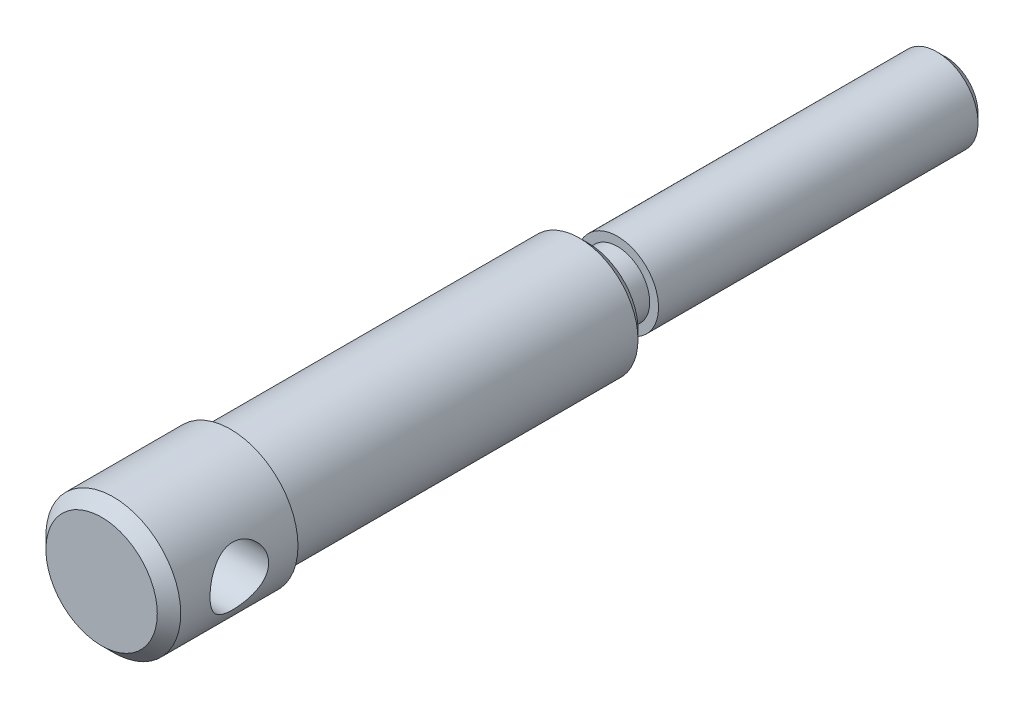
ISO-10303-21;
HEADER;
FILE_DESCRIPTION(('STEP AP214'),'2;1');
FILE_NAME('part.step','',(''),(''),'','','');
FILE_SCHEMA(('AUTOMOTIVE_DESIGN { 1 0 10303 214 1 1 1 1 }'));
ENDSEC;
DATA;
#1=APPLICATION_CONTEXT('core data for automotive mechanical design processes');
#2=APPLICATION_PROTOCOL_DEFINITION('international standard','automotive_design',2000,#1);
#3=PRODUCT_CONTEXT('',#1,'mechanical');
#4=PRODUCT('Part','Part','',(#3));
#5=PRODUCT_RELATED_PRODUCT_CATEGORY('part','',(#4));
#6=PRODUCT_DEFINITION_FORMATION('','',#4);
#7=PRODUCT_DEFINITION_CONTEXT('part definition',#1,'design');
#8=PRODUCT_DEFINITION('design','',#6,#7);
#9=PRODUCT_DEFINITION_SHAPE('','',#8);
#10=(LENGTH_UNIT() NAMED_UNIT(*) SI_UNIT(.MILLI.,.METRE.));
#11=(NAMED_UNIT(*) PLANE_ANGLE_UNIT() SI_UNIT($,.RADIAN.));
#12=(NAMED_UNIT(*) SI_UNIT($,.STERADIAN.) SOLID_ANGLE_UNIT());
#13=UNCERTAINTY_MEASURE_WITH_UNIT(LENGTH_MEASURE(1.E-05),#10,'distance_accuracy_value','');
#14=(GEOMETRIC_REPRESENTATION_CONTEXT(3) GLOBAL_UNCERTAINTY_ASSIGNED_CONTEXT((#13)) GLOBAL_UNIT_ASSIGNED_CONTEXT((#10,
#11,#12)) REPRESENTATION_CONTEXT('',''));
#15=CARTESIAN_POINT('',(0.,0.,0.));
#16=DIRECTION('',(0.,0.,1.));
#17=DIRECTION('',(1.,0.,0.));
#18=AXIS2_PLACEMENT_3D('',#15,#16,#17);
#19=CARTESIAN_POINT('',(0.,0.,-61.));
#20=DIRECTION('',(0.,0.,-1.));
#21=DIRECTION('',(-1.,0.,0.));
#22=AXIS2_PLACEMENT_3D('',#19,#20,#21);
#23=PLANE('',#22);
#24=CARTESIAN_POINT('',(0.,0.,-61.));
#25=DIRECTION('',(0.,0.,-1.));
#26=DIRECTION('',(-1.,0.,0.));
#27=AXIS2_PLACEMENT_3D('',#24,#25,#26);
#28=CIRCLE('',#27,8.49999999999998);
#29=CARTESIAN_POINT('',(-8.49999999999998,0.,-61.));
#30=VERTEX_POINT('',#29);
#31=EDGE_CURVE('E109',#30,#30,#28,.T.);
#32=ORIENTED_EDGE('',*,*,#31,.T.);
#33=EDGE_LOOP('',(#32));
#34=FACE_BOUND('',#33,.T.);
#35=CARTESIAN_POINT('',(0.,0.,-61.));
#36=DIRECTION('',(0.,0.,-1.));
#37=DIRECTION('',(-1.,0.,0.));
#38=AXIS2_PLACEMENT_3D('',#35,#36,#37);
#39=CIRCLE('',#38,5.5);
#40=CARTESIAN_POINT('',(-5.5,0.,-61.));
#41=VERTEX_POINT('',#40);
#42=EDGE_CURVE('E127',#41,#41,#39,.T.);
#43=ORIENTED_EDGE('',*,*,#42,.F.);
#44=EDGE_LOOP('',(#43));
#45=FACE_BOUND('',#44,.T.);
#46=ADVANCED_FACE('F33',(#34,#45),#23,.T.);
#47=CARTESIAN_POINT('',(0.,0.,0.));
#48=DIRECTION('',(0.,0.,1.));
#49=DIRECTION('',(1.,0.,0.));
#50=AXIS2_PLACEMENT_3D('',#47,#48,#49);
#51=PLANE('',#50);
#52=CARTESIAN_POINT('',(0.,0.,0.));
#53=DIRECTION('',(0.,0.,1.));
#54=DIRECTION('',(1.,0.,0.));
#55=AXIS2_PLACEMENT_3D('',#52,#53,#54);
#56=CIRCLE('',#55,11.5);
#57=CARTESIAN_POINT('',(11.5,0.,0.));
#58=VERTEX_POINT('',#57);
#59=EDGE_CURVE('E104',#58,#58,#56,.T.);
#60=ORIENTED_EDGE('',*,*,#59,.F.);
#61=EDGE_LOOP('',(#60));
#62=FACE_BOUND('',#61,.T.);
#63=CARTESIAN_POINT('',(0.,0.,0.));
#64=DIRECTION('',(0.,0.,1.));
#65=DIRECTION('',(1.,0.,0.));
#66=AXIS2_PLACEMENT_3D('',#63,#64,#65);
#67=CIRCLE('',#66,10.);
#68=CARTESIAN_POINT('',(10.,0.,0.));
#69=VERTEX_POINT('',#68);
#70=EDGE_CURVE('E107',#69,#69,#67,.F.);
#71=ORIENTED_EDGE('',*,*,#70,.F.);
#72=EDGE_LOOP('',(#71));
#73=FACE_BOUND('',#72,.T.);
#74=ADVANCED_FACE('F85',(#62,#73),#51,.F.);
#75=CARTESIAN_POINT('',(0.,0.,22.));
#76=DIRECTION('',(0.,0.,-1.));
#77=DIRECTION('',(-1.,0.,0.));
#78=AXIS2_PLACEMENT_3D('',#75,#76,#77);
#79=CYLINDRICAL_SURFACE('',#78,11.5);
#80=CARTESIAN_POINT('',(-11.5,0.,15.));
#81=CARTESIAN_POINT('',(-11.4999991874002,-0.133458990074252,14.9999990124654));
#82=CARTESIAN_POINT('',(-11.4976705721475,-0.26695594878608,14.9946495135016));
#83=CARTESIAN_POINT('',(-11.4884139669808,-0.532992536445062,14.9733032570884));
#84=CARTESIAN_POINT('',(-11.4814832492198,-0.665531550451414,14.9573001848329));
#85=CARTESIAN_POINT('',(-11.4631869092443,-0.928868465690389,14.9147760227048));
#86=CARTESIAN_POINT('',(-11.4518127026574,-1.05966248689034,14.8882345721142));
#87=CARTESIAN_POINT('',(-11.4249225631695,-1.31835845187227,14.8249017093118));
#88=CARTESIAN_POINT('',(-11.4094049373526,-1.44625919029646,14.7881061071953));
#89=CARTESIAN_POINT('',(-11.3746919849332,-1.69777130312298,14.7047897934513));
#90=CARTESIAN_POINT('',(-11.3555114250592,-1.8213976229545,14.658308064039));
#91=CARTESIAN_POINT('',(-11.3139069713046,-2.06414861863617,14.5559488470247));
#92=CARTESIAN_POINT('',(-11.2914818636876,-2.18327158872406,14.5000678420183));
#93=CARTESIAN_POINT('',(-11.220154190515,-2.53267560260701,14.3190527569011));
#94=CARTESIAN_POINT('',(-11.16715245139,-2.75531587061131,14.1804382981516));
#95=CARTESIAN_POINT('',(-11.0523644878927,-3.18549178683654,13.8636267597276));
#96=CARTESIAN_POINT('',(-10.9902747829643,-3.39174967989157,13.6838207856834));
#97=CARTESIAN_POINT('',(-10.8655004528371,-3.77240336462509,13.2929199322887));
#98=CARTESIAN_POINT('',(-10.8028155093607,-3.94678096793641,13.0818073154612));
#99=CARTESIAN_POINT('',(-10.7116625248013,-4.18546415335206,12.7391163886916));
#100=CARTESIAN_POINT('',(-10.6810107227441,-4.26287209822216,12.6170371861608));
#101=CARTESIAN_POINT('',(-10.6223314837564,-4.40705355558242,12.3661735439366));
#102=CARTESIAN_POINT('',(-10.5943029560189,-4.47383149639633,12.2373919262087));
#103=CARTESIAN_POINT('',(-10.5418047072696,-4.59617141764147,11.9739080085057));
#104=CARTESIAN_POINT('',(-10.5173350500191,-4.65173319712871,11.8392056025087));
#105=CARTESIAN_POINT('',(-10.4728466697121,-4.75104678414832,11.5648696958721));
#106=CARTESIAN_POINT('',(-10.452825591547,-4.79480484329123,11.4252388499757));
#107=CARTESIAN_POINT('',(-10.4188750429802,-4.86812001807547,11.149239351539));
#108=CARTESIAN_POINT('',(-10.4046884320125,-4.89828406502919,11.0130635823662));
#109=CARTESIAN_POINT('',(-10.3815389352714,-4.94715913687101,10.7382925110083));
#110=CARTESIAN_POINT('',(-10.3725735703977,-4.96587559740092,10.5996983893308));
#111=CARTESIAN_POINT('',(-10.360204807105,-4.9916291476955,10.3212246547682));
#112=CARTESIAN_POINT('',(-10.3567996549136,-4.99866992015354,10.1813454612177));
#113=CARTESIAN_POINT('',(-10.3556810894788,-5.00098714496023,9.90147108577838));
#114=CARTESIAN_POINT('',(-10.357967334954,-4.99626430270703,9.76147591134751));
#115=CARTESIAN_POINT('',(-10.3677045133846,-4.97602372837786,9.49447266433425));
#116=CARTESIAN_POINT('',(-10.3746988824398,-4.96145987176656,9.36737419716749));
#117=CARTESIAN_POINT('',(-10.3931455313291,-4.92270111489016,9.11494283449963));
#118=CARTESIAN_POINT('',(-10.404599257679,-4.89850308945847,8.98961052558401));
#119=CARTESIAN_POINT('',(-10.4316044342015,-4.84072766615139,8.7416047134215));
#120=CARTESIAN_POINT('',(-10.4471550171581,-4.80715225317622,8.61893065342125));
#121=CARTESIAN_POINT('',(-10.4818866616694,-4.7309405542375,8.37694125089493));
#122=CARTESIAN_POINT('',(-10.5010691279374,-4.68830076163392,8.25762722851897));
#123=CARTESIAN_POINT('',(-10.5641703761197,-4.5452578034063,7.90067398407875));
#124=CARTESIAN_POINT('',(-10.613035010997,-4.43096553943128,7.66930179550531));
#125=CARTESIAN_POINT('',(-10.7185281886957,-4.16929093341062,7.22819012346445));
#126=CARTESIAN_POINT('',(-10.7751599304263,-4.02189494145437,7.01845961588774));
#127=CARTESIAN_POINT('',(-10.8961990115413,-3.6821595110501,6.60595388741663));
#128=CARTESIAN_POINT('',(-10.9608402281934,-3.48691870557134,6.40563019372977));
#129=CARTESIAN_POINT('',(-11.086242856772,-3.06488466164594,6.0396446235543));
#130=CARTESIAN_POINT('',(-11.147003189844,-2.83808270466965,5.87399235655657));
#131=CARTESIAN_POINT('',(-11.2312180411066,-2.47504570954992,5.65315952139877));
#132=CARTESIAN_POINT('',(-11.2584559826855,-2.34834010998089,5.5834064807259));
#133=CARTESIAN_POINT('',(-11.3094784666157,-2.08881378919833,5.45491592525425));
#134=CARTESIAN_POINT('',(-11.3332644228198,-1.95599560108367,5.39617389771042));
#135=CARTESIAN_POINT('',(-11.3766831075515,-1.68519695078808,5.29030277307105));
#136=CARTESIAN_POINT('',(-11.396316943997,-1.54721787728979,5.24317057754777));
#137=CARTESIAN_POINT('',(-11.4308489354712,-1.26712004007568,5.16102293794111));
#138=CARTESIAN_POINT('',(-11.4457474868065,-1.12500162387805,5.12600647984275));
#139=CARTESIAN_POINT('',(-11.4695142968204,-0.847527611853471,5.07046221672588));
#140=CARTESIAN_POINT('',(-11.4787222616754,-0.712364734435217,5.04911465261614));
#141=CARTESIAN_POINT('',(-11.4923657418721,-0.440508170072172,5.01756344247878));
#142=CARTESIAN_POINT('',(-11.4968015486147,-0.303814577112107,5.00735911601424));
#143=CARTESIAN_POINT('',(-11.5007756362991,-0.0300171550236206,4.99821461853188));
#144=CARTESIAN_POINT('',(-11.5003152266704,0.107086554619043,4.99927143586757));
#145=CARTESIAN_POINT('',(-11.4945129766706,0.380638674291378,5.01262944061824));
#146=CARTESIAN_POINT('',(-11.4891712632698,0.51708710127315,5.02493033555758));
#147=CARTESIAN_POINT('',(-11.474184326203,0.780740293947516,5.05964223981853));
#148=CARTESIAN_POINT('',(-11.4647935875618,0.908038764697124,5.08145615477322));
#149=CARTESIAN_POINT('',(-11.4420202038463,1.16026535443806,5.13477575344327));
#150=CARTESIAN_POINT('',(-11.428636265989,1.28519269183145,5.16628457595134));
#151=CARTESIAN_POINT('',(-11.3982018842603,1.53180217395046,5.23868859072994));
#152=CARTESIAN_POINT('',(-11.3811524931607,1.65348523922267,5.27958108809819));
#153=CARTESIAN_POINT('',(-11.3437879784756,1.89293275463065,5.3703964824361));
#154=CARTESIAN_POINT('',(-11.3234716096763,2.01069568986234,5.420322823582));
#155=CARTESIAN_POINT('',(-11.2569520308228,2.36421123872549,5.58643538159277));
#156=CARTESIAN_POINT('',(-11.2061439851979,2.59265514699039,5.71674199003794));
#157=CARTESIAN_POINT('',(-11.097227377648,3.02514032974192,6.01038824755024));
#158=CARTESIAN_POINT('',(-11.0391156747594,3.22917103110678,6.17374212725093));
#159=CARTESIAN_POINT('',(-10.916220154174,3.62381816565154,6.54361108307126));
#160=CARTESIAN_POINT('',(-10.8512681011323,3.81217300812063,6.75248862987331));
#161=CARTESIAN_POINT('',(-10.7258763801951,4.15192368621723,7.19993633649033));
#162=CARTESIAN_POINT('',(-10.6654381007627,4.30330818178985,7.4385155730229));
#163=CARTESIAN_POINT('',(-10.5830304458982,4.50051999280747,7.81684403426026));
#164=CARTESIAN_POINT('',(-10.556709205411,4.56175038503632,7.94782384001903));
#165=CARTESIAN_POINT('',(-10.5080085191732,4.67284041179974,8.21520693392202));
#166=CARTESIAN_POINT('',(-10.4856273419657,4.72270504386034,8.35160780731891));
#167=CARTESIAN_POINT('',(-10.4456403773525,4.81050174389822,8.62879481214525));
#168=CARTESIAN_POINT('',(-10.4280320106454,4.84844025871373,8.76957852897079));
#169=CARTESIAN_POINT('',(-10.3982674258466,4.91195173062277,9.05447381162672));
#170=CARTESIAN_POINT('',(-10.386110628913,4.93752600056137,9.19858502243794));
#171=CARTESIAN_POINT('',(-10.368506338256,4.97437987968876,9.4769279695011));
#172=CARTESIAN_POINT('',(-10.3625895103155,4.98666164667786,9.61099814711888));
#173=CARTESIAN_POINT('',(-10.3559835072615,5.00036654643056,9.8798183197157));
#174=CARTESIAN_POINT('',(-10.355294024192,5.00179031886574,10.0145682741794));
#175=CARTESIAN_POINT('',(-10.3591678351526,4.99376218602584,10.2836432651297));
#176=CARTESIAN_POINT('',(-10.3637302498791,4.9843121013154,10.4179683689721));
#177=CARTESIAN_POINT('',(-10.3779395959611,4.95465826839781,10.685149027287));
#178=CARTESIAN_POINT('',(-10.3875864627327,4.93445465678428,10.8180046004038));
#179=CARTESIAN_POINT('',(-10.4109570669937,4.884943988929,11.073943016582));
#180=CARTESIAN_POINT('',(-10.4244250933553,4.85620381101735,11.1971592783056));
#181=CARTESIAN_POINT('',(-10.4551810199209,4.78962681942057,11.4406336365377));
#182=CARTESIAN_POINT('',(-10.4724701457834,4.75178708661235,11.560890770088));
#183=CARTESIAN_POINT('',(-10.5293421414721,4.62510393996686,11.9161203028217));
#184=CARTESIAN_POINT('',(-10.5739466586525,4.52306237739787,12.1457253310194));
#185=CARTESIAN_POINT('',(-10.6749593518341,4.27943987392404,12.5993996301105));
#186=CARTESIAN_POINT('',(-10.7319331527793,4.1357771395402,12.822214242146));
#187=CARTESIAN_POINT('',(-10.8498359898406,3.81577872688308,13.2418404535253));
#188=CARTESIAN_POINT('',(-10.910766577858,3.63943017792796,13.4386417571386));
#189=CARTESIAN_POINT('',(-11.0357566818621,3.24172928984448,13.8173965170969));
#190=CARTESIAN_POINT('',(-11.0996617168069,3.01786924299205,13.9967998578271));
#191=CARTESIAN_POINT('',(-11.188695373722,2.66050657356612,14.2358410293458));
#192=CARTESIAN_POINT('',(-11.2172565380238,2.53768075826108,14.3105596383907));
#193=CARTESIAN_POINT('',(-11.2713284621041,2.28554894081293,14.4493750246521));
#194=CARTESIAN_POINT('',(-11.296840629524,2.1562459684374,14.513476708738));
#195=CARTESIAN_POINT('',(-11.3437846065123,1.89370361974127,14.6297126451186));
#196=CARTESIAN_POINT('',(-11.3652646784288,1.7605362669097,14.6819902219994));
#197=CARTESIAN_POINT('',(-11.4039238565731,1.48970271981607,14.7750678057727));
#198=CARTESIAN_POINT('',(-11.4211050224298,1.35203871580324,14.8158733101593));
#199=CARTESIAN_POINT('',(-11.4506339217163,1.0735659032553,14.8854896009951));
#200=CARTESIAN_POINT('',(-11.4629933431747,0.932765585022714,14.9143294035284));
#201=CARTESIAN_POINT('',(-11.4825565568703,0.648923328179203,14.9597913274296));
#202=CARTESIAN_POINT('',(-11.4897640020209,0.505883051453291,14.9764221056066));
#203=CARTESIAN_POINT('',(-11.4961903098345,0.302085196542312,14.9912325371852));
#204=CARTESIAN_POINT('',(-11.4976179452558,0.241727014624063,14.9945192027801));
#205=CARTESIAN_POINT('',(-11.4995229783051,0.120915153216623,14.9989031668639));
#206=CARTESIAN_POINT('',(-11.5000003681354,0.0604614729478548,15.0000004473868));
#207=CARTESIAN_POINT('',(-11.5,0.,15.));
#208=B_SPLINE_CURVE_WITH_KNOTS('',3,(#80,#81,#82,#83,#84,#85,#86,#87,#88,#89,#90,#91,#92,#93,
#94,#95,#96,#97,#98,#99,#100,#101,#102,#103,#104,#105,#106,#107,#108,#109,#110,#111,#112,#113,
#114,#115,#116,#117,#118,#119,#120,#121,#122,#123,#124,#125,#126,#127,#128,#129,#130,#131,#132,
#133,#134,#135,#136,#137,#138,#139,#140,#141,#142,#143,#144,#145,#146,#147,#148,#149,#150,#151,
#152,#153,#154,#155,#156,#157,#158,#159,#160,#161,#162,#163,#164,#165,#166,#167,#168,#169,#170,
#171,#172,#173,#174,#175,#176,#177,#178,#179,#180,#181,#182,#183,#184,#185,#186,#187,#188,#189,
#190,#191,#192,#193,#194,#195,#196,#197,#198,#199,#200,#201,#202,#203,#204,#205,#206,#207),
.UNSPECIFIED.,.T.,.F.,(4,2,2,2,2,2,2,2,2,2,2,2,2,2,2,2,2,2,2,2,2,2,2,2,2,2,2,2,2,2,2,2,2,2,2,2,
2,2,2,2,2,2,2,2,2,2,2,2,2,2,2,2,2,2,2,2,2,2,2,2,2,2,2,4),(0.,0.400315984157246,
0.800869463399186,1.20220062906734,1.60369602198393,2.00360575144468,2.40366546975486,
3.20276215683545,4.04108097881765,4.8798765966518,5.32271314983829,5.7653647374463,
6.20802425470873,6.65044886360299,7.07046867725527,7.49028889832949,7.90997667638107,
8.32963928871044,8.71355143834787,9.09758822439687,9.48154378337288,9.86564815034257,
10.650033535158,11.4347429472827,12.2922718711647,13.1500381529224,13.5910935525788,
14.0319677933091,14.4727242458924,14.9134438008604,15.3243552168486,15.7352415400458,
16.1460179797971,16.5567837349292,16.9448202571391,17.3329825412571,17.7210334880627,
18.1092326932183,18.9090979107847,19.7093082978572,20.5714732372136,21.4339023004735,
21.8742960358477,22.314495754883,22.7544571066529,23.1943717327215,23.5981280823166,
24.0018606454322,24.405525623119,24.8091854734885,25.1904633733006,25.5718637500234,
26.3341347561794,27.1443093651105,27.9548036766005,28.8319183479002,29.2711960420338,
29.7102701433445,30.1436967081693,30.5769152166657,31.009076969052,31.4409320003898,
31.6222873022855,31.803644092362),.UNSPECIFIED.);
#209=CARTESIAN_POINT('',(-11.5,0.,15.));
#210=VERTEX_POINT('',#209);
#211=EDGE_CURVE('E37',#210,#210,#208,.T.);
#212=ORIENTED_EDGE('',*,*,#211,.T.);
#213=EDGE_LOOP('',(#212));
#214=FACE_BOUND('',#213,.T.);
#215=CARTESIAN_POINT('',(11.5,0.,5.));
#216=CARTESIAN_POINT('',(11.4999991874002,-0.133458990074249,5.00000098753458));
#217=CARTESIAN_POINT('',(11.4976705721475,-0.266955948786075,5.00535048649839));
#218=CARTESIAN_POINT('',(11.4884139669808,-0.532992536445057,5.02669674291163));
#219=CARTESIAN_POINT('',(11.4814832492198,-0.665531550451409,5.04269981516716));
#220=CARTESIAN_POINT('',(11.4631869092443,-0.928868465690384,5.0852239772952));
#221=CARTESIAN_POINT('',(11.4518127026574,-1.05966248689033,5.11176542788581));
#222=CARTESIAN_POINT('',(11.4249225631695,-1.31835845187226,5.17509829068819));
#223=CARTESIAN_POINT('',(11.4094049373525,-1.44625919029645,5.21189389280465));
#224=CARTESIAN_POINT('',(11.3746919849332,-1.69777130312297,5.29521020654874));
#225=CARTESIAN_POINT('',(11.3555114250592,-1.82139762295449,5.34169193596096));
#226=CARTESIAN_POINT('',(11.3139069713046,-2.06414861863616,5.44405115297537));
#227=CARTESIAN_POINT('',(11.2914818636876,-2.18327158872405,5.49993215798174));
#228=CARTESIAN_POINT('',(11.220154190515,-2.532675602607,5.6809472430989));
#229=CARTESIAN_POINT('',(11.1671524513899,-2.75531587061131,5.81956170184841));
#230=CARTESIAN_POINT('',(11.0523644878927,-3.18549178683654,6.13637324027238));
#231=CARTESIAN_POINT('',(10.9902747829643,-3.39174967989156,6.31617921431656));
#232=CARTESIAN_POINT('',(10.8655004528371,-3.77240336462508,6.70708006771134));
#233=CARTESIAN_POINT('',(10.8028155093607,-3.94678096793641,6.91819268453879));
#234=CARTESIAN_POINT('',(10.7116625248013,-4.18546415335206,7.26088361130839));
#235=CARTESIAN_POINT('',(10.6810107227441,-4.26287209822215,7.38296281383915));
#236=CARTESIAN_POINT('',(10.6223314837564,-4.40705355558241,7.63382645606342));
#237=CARTESIAN_POINT('',(10.5943029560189,-4.47383149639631,7.76260807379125));
#238=CARTESIAN_POINT('',(10.5418047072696,-4.59617141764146,8.02609199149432));
#239=CARTESIAN_POINT('',(10.5173350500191,-4.65173319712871,8.16079439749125));
#240=CARTESIAN_POINT('',(10.4728466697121,-4.75104678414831,8.43513030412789));
#241=CARTESIAN_POINT('',(10.4528255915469,-4.79480484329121,8.57476115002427));
#242=CARTESIAN_POINT('',(10.4188750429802,-4.86812001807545,8.85076064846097));
#243=CARTESIAN_POINT('',(10.4046884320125,-4.89828406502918,8.98693641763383));
#244=CARTESIAN_POINT('',(10.3815389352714,-4.94715913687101,9.26170748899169));
#245=CARTESIAN_POINT('',(10.3725735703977,-4.96587559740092,9.40030161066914));
#246=CARTESIAN_POINT('',(10.360204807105,-4.9916291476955,9.67877534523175));
#247=CARTESIAN_POINT('',(10.3567996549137,-4.99866992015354,9.81865453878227));
#248=CARTESIAN_POINT('',(10.3556810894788,-5.00098714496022,10.0985289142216));
#249=CARTESIAN_POINT('',(10.357967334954,-4.99626430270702,10.2385240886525));
#250=CARTESIAN_POINT('',(10.3677045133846,-4.97602372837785,10.5055273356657));
#251=CARTESIAN_POINT('',(10.3746988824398,-4.96145987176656,10.6326258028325));
#252=CARTESIAN_POINT('',(10.3931455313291,-4.92270111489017,10.8850571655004));
#253=CARTESIAN_POINT('',(10.404599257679,-4.89850308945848,11.010389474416));
#254=CARTESIAN_POINT('',(10.4316044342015,-4.8407276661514,11.2583952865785));
#255=CARTESIAN_POINT('',(10.4471550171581,-4.80715225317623,11.3810693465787));
#256=CARTESIAN_POINT('',(10.4818866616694,-4.73094055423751,11.6230587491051));
#257=CARTESIAN_POINT('',(10.5010691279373,-4.68830076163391,11.742372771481));
#258=CARTESIAN_POINT('',(10.5641703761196,-4.54525780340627,12.0993260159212));
#259=CARTESIAN_POINT('',(10.6130350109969,-4.43096553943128,12.3306982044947));
#260=CARTESIAN_POINT('',(10.7185281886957,-4.16929093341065,12.7718098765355));
#261=CARTESIAN_POINT('',(10.7751599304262,-4.02189494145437,12.9815403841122));
#262=CARTESIAN_POINT('',(10.8961990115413,-3.6821595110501,13.3940461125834));
#263=CARTESIAN_POINT('',(10.9608402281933,-3.48691870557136,13.5943698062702));
#264=CARTESIAN_POINT('',(11.086242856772,-3.06488466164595,13.9603553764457));
#265=CARTESIAN_POINT('',(11.1470031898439,-2.83808270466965,14.1260076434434));
#266=CARTESIAN_POINT('',(11.2312180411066,-2.47504570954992,14.3468404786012));
#267=CARTESIAN_POINT('',(11.2584559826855,-2.3483401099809,14.4165935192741));
#268=CARTESIAN_POINT('',(11.3094784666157,-2.08881378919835,14.5450840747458));
#269=CARTESIAN_POINT('',(11.3332644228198,-1.95599560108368,14.6038261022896));
#270=CARTESIAN_POINT('',(11.3766831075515,-1.68519695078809,14.709697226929));
#271=CARTESIAN_POINT('',(11.396316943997,-1.54721787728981,14.7568294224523));
#272=CARTESIAN_POINT('',(11.4308489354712,-1.26712004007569,14.8389770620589));
#273=CARTESIAN_POINT('',(11.4457474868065,-1.12500162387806,14.8739935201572));
#274=CARTESIAN_POINT('',(11.4695142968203,-0.847527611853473,14.9295377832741));
#275=CARTESIAN_POINT('',(11.4787222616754,-0.712364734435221,14.9508853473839));
#276=CARTESIAN_POINT('',(11.4923657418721,-0.440508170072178,14.9824365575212));
#277=CARTESIAN_POINT('',(11.4968015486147,-0.303814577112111,14.9926408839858));
#278=CARTESIAN_POINT('',(11.5007756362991,-0.0300171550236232,15.0017853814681));
#279=CARTESIAN_POINT('',(11.5003152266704,0.107086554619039,15.0007285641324));
#280=CARTESIAN_POINT('',(11.4945129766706,0.380638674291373,14.9873705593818));
#281=CARTESIAN_POINT('',(11.4891712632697,0.517087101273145,14.9750696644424));
#282=CARTESIAN_POINT('',(11.474184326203,0.780740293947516,14.9403577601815));
#283=CARTESIAN_POINT('',(11.4647935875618,0.908038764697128,14.9185438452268));
#284=CARTESIAN_POINT('',(11.4420202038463,1.16026535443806,14.8652242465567));
#285=CARTESIAN_POINT('',(11.428636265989,1.28519269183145,14.8337154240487));
#286=CARTESIAN_POINT('',(11.3982018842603,1.53180217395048,14.7613114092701));
#287=CARTESIAN_POINT('',(11.3811524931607,1.65348523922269,14.7204189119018));
#288=CARTESIAN_POINT('',(11.3437879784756,1.89293275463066,14.6296035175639));
#289=CARTESIAN_POINT('',(11.3234716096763,2.01069568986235,14.579677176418));
#290=CARTESIAN_POINT('',(11.2569520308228,2.36421123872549,14.4135646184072));
#291=CARTESIAN_POINT('',(11.2061439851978,2.59265514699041,14.2832580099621));
#292=CARTESIAN_POINT('',(11.097227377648,3.02514032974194,13.9896117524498));
#293=CARTESIAN_POINT('',(11.0391156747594,3.22917103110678,13.8262578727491));
#294=CARTESIAN_POINT('',(10.916220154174,3.62381816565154,13.4563889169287));
#295=CARTESIAN_POINT('',(10.8512681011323,3.81217300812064,13.2475113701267));
#296=CARTESIAN_POINT('',(10.7258763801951,4.15192368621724,12.8000636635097));
#297=CARTESIAN_POINT('',(10.6654381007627,4.30330818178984,12.5614844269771));
#298=CARTESIAN_POINT('',(10.5830304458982,4.50051999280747,12.1831559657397));
#299=CARTESIAN_POINT('',(10.556709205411,4.56175038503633,12.052176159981));
#300=CARTESIAN_POINT('',(10.5080085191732,4.67284041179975,11.784793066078));
#301=CARTESIAN_POINT('',(10.4856273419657,4.72270504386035,11.6483921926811));
#302=CARTESIAN_POINT('',(10.4456403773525,4.81050174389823,11.3712051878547));
#303=CARTESIAN_POINT('',(10.4280320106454,4.84844025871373,11.2304214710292));
#304=CARTESIAN_POINT('',(10.3982674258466,4.91195173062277,10.9455261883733));
#305=CARTESIAN_POINT('',(10.386110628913,4.93752600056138,10.801414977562));
#306=CARTESIAN_POINT('',(10.368506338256,4.97437987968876,10.5230720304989));
#307=CARTESIAN_POINT('',(10.3625895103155,4.98666164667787,10.3890018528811));
#308=CARTESIAN_POINT('',(10.3559835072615,5.00036654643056,10.1201816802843));
#309=CARTESIAN_POINT('',(10.355294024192,5.00179031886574,9.98543172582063));
#310=CARTESIAN_POINT('',(10.3591678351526,4.99376218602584,9.71635673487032));
#311=CARTESIAN_POINT('',(10.3637302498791,4.98431210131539,9.58203163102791));
#312=CARTESIAN_POINT('',(10.3779395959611,4.95465826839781,9.31485097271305));
#313=CARTESIAN_POINT('',(10.3875864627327,4.93445465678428,9.18199539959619));
#314=CARTESIAN_POINT('',(10.4109570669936,4.884943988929,8.92605698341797));
#315=CARTESIAN_POINT('',(10.4244250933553,4.85620381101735,8.80284072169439));
#316=CARTESIAN_POINT('',(10.4551810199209,4.78962681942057,8.55936636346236));
#317=CARTESIAN_POINT('',(10.4724701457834,4.75178708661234,8.43910922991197));
#318=CARTESIAN_POINT('',(10.5293421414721,4.62510393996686,8.08387969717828));
#319=CARTESIAN_POINT('',(10.5739466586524,4.52306237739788,7.85427466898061));
#320=CARTESIAN_POINT('',(10.6749593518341,4.27943987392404,7.40060036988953));
#321=CARTESIAN_POINT('',(10.7319331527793,4.13577713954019,7.17778575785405));
#322=CARTESIAN_POINT('',(10.8498359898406,3.81577872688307,6.75815954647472));
#323=CARTESIAN_POINT('',(10.910766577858,3.63943017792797,6.56135824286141));
#324=CARTESIAN_POINT('',(11.0357566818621,3.24172928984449,6.18260348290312));
#325=CARTESIAN_POINT('',(11.0996617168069,3.01786924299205,6.00320014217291));
#326=CARTESIAN_POINT('',(11.188695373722,2.66050657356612,5.7641589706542));
#327=CARTESIAN_POINT('',(11.2172565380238,2.53768075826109,5.68944036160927));
#328=CARTESIAN_POINT('',(11.2713284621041,2.28554894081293,5.55062497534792));
#329=CARTESIAN_POINT('',(11.296840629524,2.1562459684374,5.48652329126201));
#330=CARTESIAN_POINT('',(11.3437846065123,1.89370361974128,5.37028735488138));
#331=CARTESIAN_POINT('',(11.3652646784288,1.76053626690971,5.31800977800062));
#332=CARTESIAN_POINT('',(11.4039238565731,1.48970271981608,5.22493219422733));
#333=CARTESIAN_POINT('',(11.4211050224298,1.35203871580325,5.18412668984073));
#334=CARTESIAN_POINT('',(11.4506339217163,1.0735659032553,5.11451039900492));
#335=CARTESIAN_POINT('',(11.4629933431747,0.932765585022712,5.08567059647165));
#336=CARTESIAN_POINT('',(11.4825565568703,0.648923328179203,5.04020867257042));
#337=CARTESIAN_POINT('',(11.4897640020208,0.505883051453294,5.02357789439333));
#338=CARTESIAN_POINT('',(11.4961903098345,0.302085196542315,5.0087674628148));
#339=CARTESIAN_POINT('',(11.4976179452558,0.241727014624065,5.00548079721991));
#340=CARTESIAN_POINT('',(11.4995229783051,0.120915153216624,5.00109683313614));
#341=CARTESIAN_POINT('',(11.5000003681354,0.0604614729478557,4.99999955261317));
#342=CARTESIAN_POINT('',(11.5,0.,5.));
#343=B_SPLINE_CURVE_WITH_KNOTS('',3,(#215,#216,#217,#218,#219,#220,#221,#222,#223,#224,#225,
#226,#227,#228,#229,#230,#231,#232,#233,#234,#235,#236,#237,#238,#239,#240,#241,#242,#243,#244,
#245,#246,#247,#248,#249,#250,#251,#252,#253,#254,#255,#256,#257,#258,#259,#260,#261,#262,#263,
#264,#265,#266,#267,#268,#269,#270,#271,#272,#273,#274,#275,#276,#277,#278,#279,#280,#281,#282,
#283,#284,#285,#286,#287,#288,#289,#290,#291,#292,#293,#294,#295,#296,#297,#298,#299,#300,#301,
#302,#303,#304,#305,#306,#307,#308,#309,#310,#311,#312,#313,#314,#315,#316,#317,#318,#319,#320,
#321,#322,#323,#324,#325,#326,#327,#328,#329,#330,#331,#332,#333,#334,#335,#336,#337,#338,#339,
#340,#341,#342),.UNSPECIFIED.,.T.,.F.,(4,2,2,2,2,2,2,2,2,2,2,2,2,2,2,2,2,2,2,2,2,2,2,2,2,2,2,2,
2,2,2,2,2,2,2,2,2,2,2,2,2,2,2,2,2,2,2,2,2,2,2,2,2,2,2,2,2,2,2,2,2,2,2,4),(0.,0.400315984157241,
0.800869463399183,1.20220062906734,1.60369602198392,2.00360575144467,2.40366546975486,
3.20276215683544,4.04108097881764,4.87987659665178,5.32271314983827,5.76536473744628,
6.20802425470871,6.65044886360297,7.07046867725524,7.49028889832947,7.90997667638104,
8.32963928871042,8.71355143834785,9.09758822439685,9.48154378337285,9.86564815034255,
10.650033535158,11.4347429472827,12.2922718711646,13.1500381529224,13.5910935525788,
14.0319677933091,14.4727242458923,14.9134438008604,15.3243552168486,15.7352415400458,
16.1460179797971,16.5567837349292,16.9448202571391,17.3329825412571,17.7210334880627,
18.1092326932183,18.9090979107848,19.7093082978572,20.5714732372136,21.4339023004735,
21.8742960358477,22.314495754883,22.7544571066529,23.1943717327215,23.5981280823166,
24.0018606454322,24.4055256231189,24.8091854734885,25.1904633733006,25.5718637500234,
26.3341347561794,27.1443093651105,27.9548036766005,28.8319183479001,29.2711960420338,
29.7102701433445,30.1436967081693,30.5769152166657,31.009076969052,31.4409320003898,
31.6222873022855,31.803644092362),.UNSPECIFIED.);
#344=CARTESIAN_POINT('',(11.5,0.,5.));
#345=VERTEX_POINT('',#344);
#346=EDGE_CURVE('E53',#345,#345,#343,.T.);
#347=ORIENTED_EDGE('',*,*,#346,.T.);
#348=EDGE_LOOP('',(#347));
#349=FACE_BOUND('',#348,.T.);
#350=CARTESIAN_POINT('',(0.,0.,20.));
#351=DIRECTION('',(0.,0.,1.));
#352=DIRECTION('',(1.,0.,0.));
#353=AXIS2_PLACEMENT_3D('',#350,#351,#352);
#354=CIRCLE('',#353,11.5);
#355=CARTESIAN_POINT('',(11.5,0.,20.));
#356=VERTEX_POINT('',#355);
#357=EDGE_CURVE('E110',#356,#356,#354,.F.);
#358=ORIENTED_EDGE('',*,*,#357,.T.);
#359=EDGE_LOOP('',(#358));
#360=FACE_BOUND('',#359,.T.);
#361=ORIENTED_EDGE('',*,*,#59,.T.);
#362=EDGE_LOOP('',(#361));
#363=FACE_BOUND('',#362,.T.);
#364=ADVANCED_FACE('F57',(#214,#349,#360,#363),#79,.T.);
#365=CARTESIAN_POINT('',(0.,0.,22.));
#366=DIRECTION('',(0.,0.,1.));
#367=DIRECTION('',(1.,0.,0.));
#368=AXIS2_PLACEMENT_3D('',#365,#366,#367);
#369=PLANE('',#368);
#370=CARTESIAN_POINT('',(0.,0.,22.));
#371=DIRECTION('',(0.,0.,1.));
#372=DIRECTION('',(1.,0.,0.));
#373=AXIS2_PLACEMENT_3D('',#370,#371,#372);
#374=CIRCLE('',#373,9.5);
#375=CARTESIAN_POINT('',(9.5,0.,22.));
#376=VERTEX_POINT('',#375);
#377=EDGE_CURVE('E115',#376,#376,#374,.T.);
#378=ORIENTED_EDGE('',*,*,#377,.T.);
#379=EDGE_LOOP('',(#378));
#380=FACE_BOUND('',#379,.T.);
#381=ADVANCED_FACE('F92',(#380),#369,.T.);
#382=CARTESIAN_POINT('',(0.,0.,22.));
#383=DIRECTION('',(0.,0.,-1.));
#384=DIRECTION('',(-1.,0.,0.));
#385=AXIS2_PLACEMENT_3D('',#382,#383,#384);
#386=CONICAL_SURFACE('',#385,9.5,0.785398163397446);
#387=ORIENTED_EDGE('',*,*,#357,.F.);
#388=EDGE_LOOP('',(#387));
#389=FACE_BOUND('',#388,.T.);
#390=ORIENTED_EDGE('',*,*,#377,.F.);
#391=EDGE_LOOP('',(#390));
#392=FACE_BOUND('',#391,.T.);
#393=ADVANCED_FACE('F90',(#389,#392),#386,.T.);
#394=CARTESIAN_POINT('',(0.,0.,-61.));
#395=DIRECTION('',(0.,0.,1.));
#396=DIRECTION('',(1.,0.,0.));
#397=AXIS2_PLACEMENT_3D('',#394,#395,#396);
#398=CYLINDRICAL_SURFACE('',#397,10.);
#399=CARTESIAN_POINT('',(0.,0.,-59.5));
#400=DIRECTION('',(0.,0.,-1.));
#401=DIRECTION('',(-1.,0.,0.));
#402=AXIS2_PLACEMENT_3D('',#399,#400,#401);
#403=CIRCLE('',#402,10.);
#404=CARTESIAN_POINT('',(10.,0.,-59.5));
#405=VERTEX_POINT('',#404);
#406=EDGE_CURVE('E50',#405,#405,#403,.F.);
#407=CARTESIAN_POINT('',(10.,0.,-59.5));
#408=CARTESIAN_POINT('',(10.,0.,-58.8802083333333));
#409=CARTESIAN_POINT('',(10.,0.,-58.2604166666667));
#410=CARTESIAN_POINT('',(10.,0.,-57.0208333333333));
#411=CARTESIAN_POINT('',(10.,0.,-56.4010416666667));
#412=CARTESIAN_POINT('',(10.,0.,-55.1614583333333));
#413=CARTESIAN_POINT('',(10.,0.,-54.5416666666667));
#414=CARTESIAN_POINT('',(10.,0.,-53.3020833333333));
#415=CARTESIAN_POINT('',(10.,0.,-52.6822916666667));
#416=CARTESIAN_POINT('',(10.,0.,-51.4427083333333));
#417=CARTESIAN_POINT('',(10.,0.,-50.8229166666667));
#418=CARTESIAN_POINT('',(10.,0.,-49.5833333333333));
#419=CARTESIAN_POINT('',(10.,0.,-48.9635416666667));
#420=CARTESIAN_POINT('',(10.,0.,-47.7239583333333));
#421=CARTESIAN_POINT('',(10.,0.,-47.1041666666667));
#422=CARTESIAN_POINT('',(10.,0.,-45.8645833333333));
#423=CARTESIAN_POINT('',(10.,0.,-45.2447916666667));
#424=CARTESIAN_POINT('',(10.,0.,-44.0052083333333));
#425=CARTESIAN_POINT('',(10.,0.,-43.3854166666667));
#426=CARTESIAN_POINT('',(10.,0.,-42.1458333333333));
#427=CARTESIAN_POINT('',(10.,0.,-41.5260416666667));
#428=CARTESIAN_POINT('',(10.,0.,-40.2864583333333));
#429=CARTESIAN_POINT('',(10.,0.,-39.6666666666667));
#430=CARTESIAN_POINT('',(10.,0.,-38.4270833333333));
#431=CARTESIAN_POINT('',(10.,0.,-37.8072916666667));
#432=CARTESIAN_POINT('',(10.,0.,-36.5677083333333));
#433=CARTESIAN_POINT('',(10.,0.,-35.9479166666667));
#434=CARTESIAN_POINT('',(10.,0.,-34.7083333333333));
#435=CARTESIAN_POINT('',(10.,0.,-34.0885416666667));
#436=CARTESIAN_POINT('',(10.,0.,-32.8489583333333));
#437=CARTESIAN_POINT('',(10.,0.,-32.2291666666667));
#438=CARTESIAN_POINT('',(10.,0.,-30.9895833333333));
#439=CARTESIAN_POINT('',(10.,0.,-30.3697916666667));
#440=CARTESIAN_POINT('',(10.,0.,-29.1302083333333));
#441=CARTESIAN_POINT('',(10.,0.,-28.5104166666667));
#442=CARTESIAN_POINT('',(10.,0.,-27.2708333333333));
#443=CARTESIAN_POINT('',(10.,0.,-26.6510416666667));
#444=CARTESIAN_POINT('',(10.,0.,-25.4114583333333));
#445=CARTESIAN_POINT('',(10.,0.,-24.7916666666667));
#446=CARTESIAN_POINT('',(10.,0.,-23.5520833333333));
#447=CARTESIAN_POINT('',(10.,0.,-22.9322916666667));
#448=CARTESIAN_POINT('',(10.,0.,-21.6927083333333));
#449=CARTESIAN_POINT('',(10.,0.,-21.0729166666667));
#450=CARTESIAN_POINT('',(10.,0.,-19.8333333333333));
#451=CARTESIAN_POINT('',(10.,0.,-19.2135416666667));
#452=CARTESIAN_POINT('',(10.,0.,-17.9739583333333));
#453=CARTESIAN_POINT('',(10.,0.,-17.3541666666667));
#454=CARTESIAN_POINT('',(10.,0.,-16.1145833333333));
#455=CARTESIAN_POINT('',(10.,0.,-15.4947916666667));
#456=CARTESIAN_POINT('',(10.,0.,-14.2552083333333));
#457=CARTESIAN_POINT('',(10.,0.,-13.6354166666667));
#458=CARTESIAN_POINT('',(10.,0.,-12.3958333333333));
#459=CARTESIAN_POINT('',(10.,0.,-11.7760416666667));
#460=CARTESIAN_POINT('',(10.,0.,-10.5364583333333));
#461=CARTESIAN_POINT('',(10.,0.,-9.91666666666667));
#462=CARTESIAN_POINT('',(10.,0.,-8.67708333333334));
#463=CARTESIAN_POINT('',(10.,0.,-8.05729166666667));
#464=CARTESIAN_POINT('',(10.,0.,-6.81770833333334));
#465=CARTESIAN_POINT('',(10.,0.,-6.19791666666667));
#466=CARTESIAN_POINT('',(10.,0.,-4.95833333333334));
#467=CARTESIAN_POINT('',(10.,0.,-4.33854166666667));
#468=CARTESIAN_POINT('',(10.,0.,-3.09895833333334));
#469=CARTESIAN_POINT('',(10.,0.,-2.47916666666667));
#470=CARTESIAN_POINT('',(10.,0.,-1.23958333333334));
#471=CARTESIAN_POINT('',(10.,0.,-0.619791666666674));
#472=CARTESIAN_POINT('',(10.,0.,0.));
#473=B_SPLINE_CURVE_WITH_KNOTS('',3,(#407,#408,#409,#410,#411,#412,#413,#414,#415,#416,#417,
#418,#419,#420,#421,#422,#423,#424,#425,#426,#427,#428,#429,#430,#431,#432,#433,#434,#435,#436,
#437,#438,#439,#440,#441,#442,#443,#444,#445,#446,#447,#448,#449,#450,#451,#452,#453,#454,#455,
#456,#457,#458,#459,#460,#461,#462,#463,#464,#465,#466,#467,#468,#469,#470,#471,#472),
.UNSPECIFIED.,.F.,.F.,(4,2,2,2,2,2,2,2,2,2,2,2,2,2,2,2,2,2,2,2,2,2,2,2,2,2,2,2,2,2,2,2,4),(0.,
1.859375,3.71874999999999,5.578125,7.43749999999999,9.29687499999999,11.15625,13.015625,14.875,
16.734375,18.59375,20.453125,22.3125,24.171875,26.03125,27.890625,29.75,31.609375,33.46875,
35.328125,37.1875,39.046875,40.90625,42.765625,44.625,46.484375,48.34375,50.203125,52.0625,
53.921875,55.78125,57.640625,59.5),.UNSPECIFIED.);
#474=EDGE_CURVE('BSEAM87',#405,#69,#473,.T.);
#475=ORIENTED_EDGE('',*,*,#406,.T.);
#476=ORIENTED_EDGE('',*,*,#70,.T.);
#477=ORIENTED_EDGE('',*,*,#474,.T.);
#478=ORIENTED_EDGE('',*,*,#474,.F.);
#479=EDGE_LOOP('',(#475,#477,#476,#478));
#480=FACE_BOUND('',#479,.T.);
#481=ADVANCED_FACE('F87',(#480),#398,.T.);
#482=CARTESIAN_POINT('',(0.,0.,-61.));
#483=DIRECTION('',(0.,0.,1.));
#484=DIRECTION('',(1.,0.,0.));
#485=AXIS2_PLACEMENT_3D('',#482,#483,#484);
#486=CONICAL_SURFACE('',#485,8.49999999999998,0.785398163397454);
#487=ORIENTED_EDGE('',*,*,#406,.F.);
#488=EDGE_LOOP('',(#487));
#489=FACE_BOUND('',#488,.T.);
#490=ORIENTED_EDGE('',*,*,#31,.F.);
#491=EDGE_LOOP('',(#490));
#492=FACE_BOUND('',#491,.T.);
#493=ADVANCED_FACE('F81',(#489,#492),#486,.T.);
#494=CARTESIAN_POINT('',(0.,0.,-66.));
#495=DIRECTION('',(0.,0.,1.));
#496=DIRECTION('',(1.,0.,0.));
#497=AXIS2_PLACEMENT_3D('',#494,#495,#496);
#498=CYLINDRICAL_SURFACE('',#497,5.5);
#499=CARTESIAN_POINT('',(0.,0.,-66.));
#500=DIRECTION('',(0.,0.,-1.));
#501=DIRECTION('',(-1.,0.,0.));
#502=AXIS2_PLACEMENT_3D('',#499,#500,#501);
#503=CIRCLE('',#502,5.5);
#504=CARTESIAN_POINT('',(-5.5,0.,-66.));
#505=VERTEX_POINT('',#504);
#506=EDGE_CURVE('E129',#505,#505,#503,.T.);
#507=ORIENTED_EDGE('',*,*,#506,.F.);
#508=EDGE_LOOP('',(#507));
#509=FACE_BOUND('',#508,.T.);
#510=ORIENTED_EDGE('',*,*,#42,.T.);
#511=EDGE_LOOP('',(#510));
#512=FACE_BOUND('',#511,.T.);
#513=ADVANCED_FACE('F75',(#509,#512),#498,.T.);
#514=CARTESIAN_POINT('',(0.,0.,-66.));
#515=DIRECTION('',(0.,0.,-1.));
#516=DIRECTION('',(-1.,0.,0.));
#517=AXIS2_PLACEMENT_3D('',#514,#515,#516);
#518=PLANE('',#517);
#519=CARTESIAN_POINT('',(0.,0.,-66.));
#520=DIRECTION('',(0.,0.,-1.));
#521=DIRECTION('',(-1.,0.,0.));
#522=AXIS2_PLACEMENT_3D('',#519,#520,#521);
#523=CIRCLE('',#522,7.);
#524=CARTESIAN_POINT('',(-7.,0.,-66.));
#525=VERTEX_POINT('',#524);
#526=EDGE_CURVE('E130',#525,#525,#523,.T.);
#527=ORIENTED_EDGE('',*,*,#526,.F.);
#528=EDGE_LOOP('',(#527));
#529=FACE_BOUND('',#528,.T.);
#530=ORIENTED_EDGE('',*,*,#506,.T.);
#531=EDGE_LOOP('',(#530));
#532=FACE_BOUND('',#531,.T.);
#533=ADVANCED_FACE('F72',(#529,#532),#518,.F.);
#534=CARTESIAN_POINT('',(0.,0.,-122.));
#535=DIRECTION('',(0.,0.,1.));
#536=DIRECTION('',(1.,0.,0.));
#537=AXIS2_PLACEMENT_3D('',#534,#535,#536);
#538=CYLINDRICAL_SURFACE('',#537,7.);
#539=CARTESIAN_POINT('',(0.,0.,-120.5));
#540=DIRECTION('',(0.,0.,-1.));
#541=DIRECTION('',(-1.,0.,0.));
#542=AXIS2_PLACEMENT_3D('',#539,#540,#541);
#543=CIRCLE('',#542,7.);
#544=CARTESIAN_POINT('',(-7.,0.,-120.5));
#545=VERTEX_POINT('',#544);
#546=EDGE_CURVE('E10',#545,#545,#543,.F.);
#547=ORIENTED_EDGE('',*,*,#546,.T.);
#548=EDGE_LOOP('',(#547));
#549=FACE_BOUND('',#548,.T.);
#550=ORIENTED_EDGE('',*,*,#526,.T.);
#551=EDGE_LOOP('',(#550));
#552=FACE_BOUND('',#551,.T.);
#553=ADVANCED_FACE('F70',(#549,#552),#538,.T.);
#554=CARTESIAN_POINT('',(0.,0.,-122.));
#555=DIRECTION('',(0.,0.,-1.));
#556=DIRECTION('',(-1.,0.,0.));
#557=AXIS2_PLACEMENT_3D('',#554,#555,#556);
#558=PLANE('',#557);
#559=CARTESIAN_POINT('',(0.,0.,-122.));
#560=DIRECTION('',(0.,0.,-1.));
#561=DIRECTION('',(-1.,0.,0.));
#562=AXIS2_PLACEMENT_3D('',#559,#560,#561);
#563=CIRCLE('',#562,5.49999999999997);
#564=CARTESIAN_POINT('',(-5.49999999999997,0.,-122.));
#565=VERTEX_POINT('',#564);
#566=EDGE_CURVE('E45',#565,#565,#563,.T.);
#567=ORIENTED_EDGE('',*,*,#566,.T.);
#568=EDGE_LOOP('',(#567));
#569=FACE_BOUND('',#568,.T.);
#570=ADVANCED_FACE('F66',(#569),#558,.T.);
#571=CARTESIAN_POINT('',(0.,0.,-122.));
#572=DIRECTION('',(0.,0.,1.));
#573=DIRECTION('',(1.,0.,0.));
#574=AXIS2_PLACEMENT_3D('',#571,#572,#573);
#575=CONICAL_SURFACE('',#574,5.49999999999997,0.785398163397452);
#576=ORIENTED_EDGE('',*,*,#546,.F.);
#577=EDGE_LOOP('',(#576));
#578=FACE_BOUND('',#577,.T.);
#579=ORIENTED_EDGE('',*,*,#566,.F.);
#580=EDGE_LOOP('',(#579));
#581=FACE_BOUND('',#580,.T.);
#582=ADVANCED_FACE('F35',(#578,#581),#575,.T.);
#583=CARTESIAN_POINT('',(-20.,0.,10.));
#584=DIRECTION('',(1.,0.,0.));
#585=DIRECTION('',(0.,0.,-1.));
#586=AXIS2_PLACEMENT_3D('',#583,#584,#585);
#587=CYLINDRICAL_SURFACE('',#586,5.);
#588=ORIENTED_EDGE('',*,*,#346,.F.);
#589=EDGE_LOOP('',(#588));
#590=FACE_BOUND('',#589,.T.);
#591=ORIENTED_EDGE('',*,*,#211,.F.);
#592=EDGE_LOOP('',(#591));
#593=FACE_BOUND('',#592,.T.);
#594=ADVANCED_FACE('F61',(#590,#593),#587,.F.);
#595=CLOSED_SHELL('',(#46,#74,#364,#381,#393,#481,#493,#513,#533,#553,#570,#582,#594));
#596=MANIFOLD_SOLID_BREP('B2',#595);
#597=ADVANCED_BREP_SHAPE_REPRESENTATION('',(#18,#596),#14);
#598=SHAPE_DEFINITION_REPRESENTATION(#9,#597);
ENDSEC;
END-ISO-10303-21;
